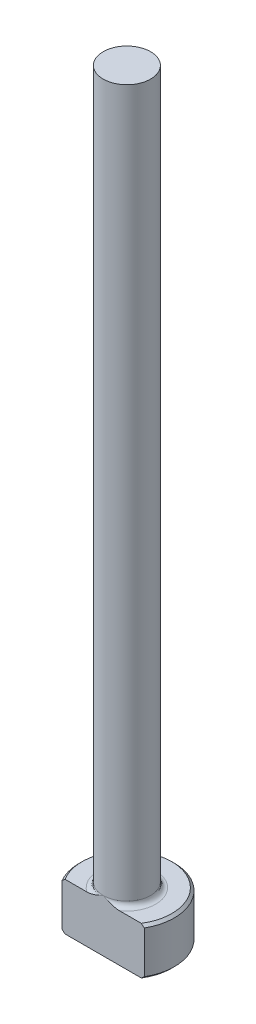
from build123d import *

# Parameters (mm, degrees)
CHAMFER1_SIZE = 0.254
FILLET1_R     = 0.508
KEY_DEPTH     = 77.49707715


with BuildPart() as part:
    # Sketch1 → Revolve1 (revolve)
    with BuildSketch(Plane.XY, mode=Mode.PRIVATE) as revolve1_sk:
        Polygon((0, 0), (-4.7625, 0), (-4.7625, 4.7498), (-2.38125, 4.7498), (-2.38125, 76.2), (0, 76.2), align=None)
    revolve(revolve1_sk.sketch.rotate(Axis((0, 259.958771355, 0), (0, -1, 0)), 270), axis=Axis((0, 259.958771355, 0), (0, -1, 0)))

    # Chamfer1
    chamfer1_edges = [part.edges().sort_by_distance(p)[0] for p in [
        (0, 4.7498, -4.7625),
        (0, 0, -4.7625),
    ]]
    chamfer(chamfer1_edges, length=CHAMFER1_SIZE)

    # Fillet1
    fillet1_edges = [part.edges().sort_by_distance(p)[0] for p in [
        (0, 4.7498, -2.38125),
    ]]
    fillet(fillet1_edges, radius=FILLET1_R)

    # Sketch2 → Key (cut, through all)
    with BuildSketch(Plane(origin=(0, 0, 0), x_dir=(1, 0, 0), z_dir=(0, 1, 0))):
        with BuildLine():
            Line((-4.124445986, -2.38125), (4.124445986, -2.38125))
            ThreePointArc((4.124445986, -2.38125), (0, -4.7625), (-4.124445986, -2.38125))
        make_face()
    extrude(amount=KEY_DEPTH, mode=Mode.SUBTRACT)


solid = part.part
